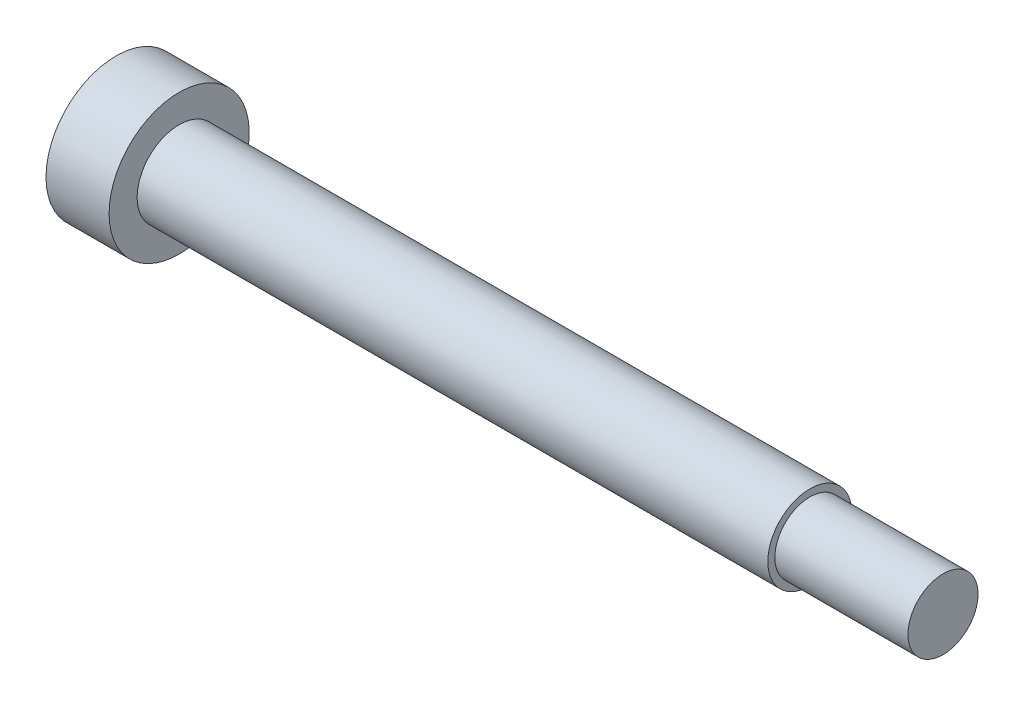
ISO-10303-21;
HEADER;
FILE_DESCRIPTION(('STEP AP214'),'2;1');
FILE_NAME('part.step','',(''),(''),'','','');
FILE_SCHEMA(('AUTOMOTIVE_DESIGN { 1 0 10303 214 1 1 1 1 }'));
ENDSEC;
DATA;
#1=APPLICATION_CONTEXT('core data for automotive mechanical design processes');
#2=APPLICATION_PROTOCOL_DEFINITION('international standard','automotive_design',2000,#1);
#3=PRODUCT_CONTEXT('',#1,'mechanical');
#4=PRODUCT('Part','Part','',(#3));
#5=PRODUCT_RELATED_PRODUCT_CATEGORY('part','',(#4));
#6=PRODUCT_DEFINITION_FORMATION('','',#4);
#7=PRODUCT_DEFINITION_CONTEXT('part definition',#1,'design');
#8=PRODUCT_DEFINITION('design','',#6,#7);
#9=PRODUCT_DEFINITION_SHAPE('','',#8);
#10=(LENGTH_UNIT() NAMED_UNIT(*) SI_UNIT(.MILLI.,.METRE.));
#11=(NAMED_UNIT(*) PLANE_ANGLE_UNIT() SI_UNIT($,.RADIAN.));
#12=(NAMED_UNIT(*) SI_UNIT($,.STERADIAN.) SOLID_ANGLE_UNIT());
#13=UNCERTAINTY_MEASURE_WITH_UNIT(LENGTH_MEASURE(1.E-05),#10,'distance_accuracy_value','');
#14=(GEOMETRIC_REPRESENTATION_CONTEXT(3) GLOBAL_UNCERTAINTY_ASSIGNED_CONTEXT((#13)) GLOBAL_UNIT_ASSIGNED_CONTEXT((#10,
#11,#12)) REPRESENTATION_CONTEXT('',''));
#15=CARTESIAN_POINT('',(0.,0.,0.));
#16=DIRECTION('',(0.,0.,1.));
#17=DIRECTION('',(1.,0.,0.));
#18=AXIS2_PLACEMENT_3D('',#15,#16,#17);
#19=CARTESIAN_POINT('',(0.,0.,0.));
#20=DIRECTION('',(1.,0.,0.));
#21=DIRECTION('',(0.,0.,-1.));
#22=AXIS2_PLACEMENT_3D('',#19,#20,#21);
#23=PLANE('',#22);
#24=DIRECTION('',(0.,0.866025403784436,-0.5));
#25=VECTOR('',#24,1.);
#26=CARTESIAN_POINT('',(0.,0.,2.));
#27=LINE('',#26,#25);
#28=CARTESIAN_POINT('',(0.,0.,2.));
#29=VERTEX_POINT('',#28);
#30=CARTESIAN_POINT('',(0.,1.73205080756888,1.));
#31=VERTEX_POINT('',#30);
#32=EDGE_CURVE('E104',#29,#31,#27,.T.);
#33=ORIENTED_EDGE('',*,*,#32,.F.);
#34=DIRECTION('',(0.,0.866025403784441,0.5));
#35=VECTOR('',#34,1.);
#36=CARTESIAN_POINT('',(0.,-1.73205080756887,1.));
#37=LINE('',#36,#35);
#38=CARTESIAN_POINT('',(0.,-1.73205080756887,1.));
#39=VERTEX_POINT('',#38);
#40=EDGE_CURVE('E30',#39,#29,#37,.T.);
#41=ORIENTED_EDGE('',*,*,#40,.F.);
#42=DIRECTION('',(0.,0.,1.));
#43=VECTOR('',#42,1.);
#44=CARTESIAN_POINT('',(0.,-1.73205080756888,-1.));
#45=LINE('',#44,#43);
#46=CARTESIAN_POINT('',(0.,-1.73205080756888,-1.));
#47=VERTEX_POINT('',#46);
#48=EDGE_CURVE('E113',#47,#39,#45,.T.);
#49=ORIENTED_EDGE('',*,*,#48,.F.);
#50=DIRECTION('',(0.,-0.866025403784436,0.5));
#51=VECTOR('',#50,1.);
#52=CARTESIAN_POINT('',(0.,0.,-2.));
#53=LINE('',#52,#51);
#54=CARTESIAN_POINT('',(0.,0.,-2.));
#55=VERTEX_POINT('',#54);
#56=EDGE_CURVE('E111',#55,#47,#53,.T.);
#57=ORIENTED_EDGE('',*,*,#56,.F.);
#58=DIRECTION('',(0.,-0.866025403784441,-0.5));
#59=VECTOR('',#58,1.);
#60=CARTESIAN_POINT('',(0.,1.73205080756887,-1.));
#61=LINE('',#60,#59);
#62=CARTESIAN_POINT('',(0.,1.73205080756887,-1.));
#63=VERTEX_POINT('',#62);
#64=EDGE_CURVE('E78',#63,#55,#61,.T.);
#65=ORIENTED_EDGE('',*,*,#64,.F.);
#66=DIRECTION('',(0.,0.,-1.));
#67=VECTOR('',#66,1.);
#68=CARTESIAN_POINT('',(0.,1.73205080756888,1.));
#69=LINE('',#68,#67);
#70=EDGE_CURVE('E107',#31,#63,#69,.T.);
#71=ORIENTED_EDGE('',*,*,#70,.F.);
#72=EDGE_LOOP('',(#33,#41,#49,#57,#65,#71));
#73=FACE_BOUND('',#72,.T.);
#74=CARTESIAN_POINT('',(0.,0.,0.));
#75=DIRECTION('',(-1.,0.,0.));
#76=DIRECTION('',(0.,0.,1.));
#77=AXIS2_PLACEMENT_3D('',#74,#75,#76);
#78=CIRCLE('',#77,5.);
#79=CARTESIAN_POINT('',(0.,0.,5.));
#80=VERTEX_POINT('',#79);
#81=EDGE_CURVE('E10',#80,#80,#78,.T.);
#82=ORIENTED_EDGE('',*,*,#81,.T.);
#83=EDGE_LOOP('',(#82));
#84=FACE_BOUND('',#83,.T.);
#85=ADVANCED_FACE('F16',(#73,#84),#23,.F.);
#86=CARTESIAN_POINT('',(0.,0.,0.));
#87=DIRECTION('',(-1.,0.,0.));
#88=DIRECTION('',(0.,0.,1.));
#89=AXIS2_PLACEMENT_3D('',#86,#87,#88);
#90=CYLINDRICAL_SURFACE('',#89,5.);
#91=ORIENTED_EDGE('',*,*,#81,.F.);
#92=EDGE_LOOP('',(#91));
#93=FACE_BOUND('',#92,.T.);
#94=CARTESIAN_POINT('',(4.5,0.,0.));
#95=DIRECTION('',(-1.,0.,0.));
#96=DIRECTION('',(0.,0.,1.));
#97=AXIS2_PLACEMENT_3D('',#94,#95,#96);
#98=CIRCLE('',#97,5.);
#99=CARTESIAN_POINT('',(4.5,0.,5.));
#100=VERTEX_POINT('',#99);
#101=EDGE_CURVE('E23',#100,#100,#98,.T.);
#102=ORIENTED_EDGE('',*,*,#101,.T.);
#103=EDGE_LOOP('',(#102));
#104=FACE_BOUND('',#103,.T.);
#105=ADVANCED_FACE('F136',(#93,#104),#90,.T.);
#106=CARTESIAN_POINT('',(4.5,5.,0.));
#107=DIRECTION('',(-1.,0.,0.));
#108=DIRECTION('',(0.,0.,1.));
#109=AXIS2_PLACEMENT_3D('',#106,#107,#108);
#110=PLANE('',#109);
#111=ORIENTED_EDGE('',*,*,#101,.F.);
#112=EDGE_LOOP('',(#111));
#113=FACE_BOUND('',#112,.T.);
#114=CARTESIAN_POINT('',(4.5,0.,0.));
#115=DIRECTION('',(-1.,0.,0.));
#116=DIRECTION('',(0.,0.,1.));
#117=AXIS2_PLACEMENT_3D('',#114,#115,#116);
#118=CIRCLE('',#117,3.);
#119=CARTESIAN_POINT('',(4.5,0.,3.));
#120=VERTEX_POINT('',#119);
#121=EDGE_CURVE('E131',#120,#120,#118,.T.);
#122=ORIENTED_EDGE('',*,*,#121,.T.);
#123=EDGE_LOOP('',(#122));
#124=FACE_BOUND('',#123,.T.);
#125=ADVANCED_FACE('F138',(#113,#124),#110,.F.);
#126=CARTESIAN_POINT('',(0.,0.,0.));
#127=DIRECTION('',(-1.,0.,0.));
#128=DIRECTION('',(0.,0.,1.));
#129=AXIS2_PLACEMENT_3D('',#126,#127,#128);
#130=CYLINDRICAL_SURFACE('',#129,3.);
#131=ORIENTED_EDGE('',*,*,#121,.F.);
#132=EDGE_LOOP('',(#131));
#133=FACE_BOUND('',#132,.T.);
#134=CARTESIAN_POINT('',(49.5,0.,0.));
#135=DIRECTION('',(-1.,0.,0.));
#136=DIRECTION('',(0.,0.,1.));
#137=AXIS2_PLACEMENT_3D('',#134,#135,#136);
#138=CIRCLE('',#137,3.);
#139=CARTESIAN_POINT('',(49.5,0.,3.));
#140=VERTEX_POINT('',#139);
#141=EDGE_CURVE('E128',#140,#140,#138,.T.);
#142=ORIENTED_EDGE('',*,*,#141,.T.);
#143=EDGE_LOOP('',(#142));
#144=FACE_BOUND('',#143,.T.);
#145=ADVANCED_FACE('F141',(#133,#144),#130,.T.);
#146=CARTESIAN_POINT('',(49.5,3.,0.));
#147=DIRECTION('',(-1.,0.,0.));
#148=DIRECTION('',(0.,0.,1.));
#149=AXIS2_PLACEMENT_3D('',#146,#147,#148);
#150=PLANE('',#149);
#151=ORIENTED_EDGE('',*,*,#141,.F.);
#152=EDGE_LOOP('',(#151));
#153=FACE_BOUND('',#152,.T.);
#154=CARTESIAN_POINT('',(49.5,0.,0.));
#155=DIRECTION('',(-1.,0.,0.));
#156=DIRECTION('',(0.,0.,1.));
#157=AXIS2_PLACEMENT_3D('',#154,#155,#156);
#158=CIRCLE('',#157,2.5);
#159=CARTESIAN_POINT('',(49.5,0.,2.5));
#160=VERTEX_POINT('',#159);
#161=EDGE_CURVE('E125',#160,#160,#158,.T.);
#162=ORIENTED_EDGE('',*,*,#161,.T.);
#163=EDGE_LOOP('',(#162));
#164=FACE_BOUND('',#163,.T.);
#165=ADVANCED_FACE('F147',(#153,#164),#150,.F.);
#166=CARTESIAN_POINT('',(0.,0.,0.));
#167=DIRECTION('',(-1.,0.,0.));
#168=DIRECTION('',(0.,0.,1.));
#169=AXIS2_PLACEMENT_3D('',#166,#167,#168);
#170=CYLINDRICAL_SURFACE('',#169,2.5);
#171=ORIENTED_EDGE('',*,*,#161,.F.);
#172=EDGE_LOOP('',(#171));
#173=FACE_BOUND('',#172,.T.);
#174=CARTESIAN_POINT('',(59.,0.,0.));
#175=DIRECTION('',(-1.,0.,0.));
#176=DIRECTION('',(0.,0.,1.));
#177=AXIS2_PLACEMENT_3D('',#174,#175,#176);
#178=CIRCLE('',#177,2.5);
#179=CARTESIAN_POINT('',(59.,0.,2.5));
#180=VERTEX_POINT('',#179);
#181=EDGE_CURVE('E117',#180,#180,#178,.T.);
#182=ORIENTED_EDGE('',*,*,#181,.T.);
#183=EDGE_LOOP('',(#182));
#184=FACE_BOUND('',#183,.T.);
#185=ADVANCED_FACE('F153',(#173,#184),#170,.T.);
#186=CARTESIAN_POINT('',(59.,2.5,0.));
#187=DIRECTION('',(-1.,0.,0.));
#188=DIRECTION('',(0.,0.,1.));
#189=AXIS2_PLACEMENT_3D('',#186,#187,#188);
#190=PLANE('',#189);
#191=ORIENTED_EDGE('',*,*,#181,.F.);
#192=EDGE_LOOP('',(#191));
#193=FACE_BOUND('',#192,.T.);
#194=ADVANCED_FACE('F159',(#193),#190,.F.);
#195=CARTESIAN_POINT('',(3.,-1.73205080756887,1.));
#196=DIRECTION('',(0.,-0.5,0.866025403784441));
#197=DIRECTION('',(0.,-0.866025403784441,-0.5));
#198=AXIS2_PLACEMENT_3D('',#195,#196,#197);
#199=PLANE('',#198);
#200=ORIENTED_EDGE('',*,*,#40,.T.);
#201=DIRECTION('',(-1.,0.,0.));
#202=VECTOR('',#201,1.);
#203=CARTESIAN_POINT('',(3.,0.,2.));
#204=LINE('',#203,#202);
#205=CARTESIAN_POINT('',(3.,0.,2.));
#206=VERTEX_POINT('',#205);
#207=EDGE_CURVE('E60',#206,#29,#204,.T.);
#208=ORIENTED_EDGE('',*,*,#207,.F.);
#209=DIRECTION('',(0.,0.866025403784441,0.5));
#210=VECTOR('',#209,1.);
#211=CARTESIAN_POINT('',(3.,-1.73205080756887,1.));
#212=LINE('',#211,#210);
#213=CARTESIAN_POINT('',(3.,-1.73205080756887,1.));
#214=VERTEX_POINT('',#213);
#215=EDGE_CURVE('E115',#214,#206,#212,.T.);
#216=ORIENTED_EDGE('',*,*,#215,.F.);
#217=DIRECTION('',(-1.,0.,0.));
#218=VECTOR('',#217,1.);
#219=CARTESIAN_POINT('',(3.,-1.73205080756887,1.));
#220=LINE('',#219,#218);
#221=EDGE_CURVE('E38',#214,#39,#220,.T.);
#222=ORIENTED_EDGE('',*,*,#221,.T.);
#223=EDGE_LOOP('',(#200,#208,#216,#222));
#224=FACE_BOUND('',#223,.T.);
#225=ADVANCED_FACE('F164',(#224),#199,.F.);
#226=CARTESIAN_POINT('',(3.,-1.73205080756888,-1.));
#227=DIRECTION('',(0.,-1.,0.));
#228=DIRECTION('',(0.,0.,-1.));
#229=AXIS2_PLACEMENT_3D('',#226,#227,#228);
#230=PLANE('',#229);
#231=ORIENTED_EDGE('',*,*,#48,.T.);
#232=ORIENTED_EDGE('',*,*,#221,.F.);
#233=DIRECTION('',(0.,0.,1.));
#234=VECTOR('',#233,1.);
#235=CARTESIAN_POINT('',(3.,-1.73205080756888,-1.));
#236=LINE('',#235,#234);
#237=CARTESIAN_POINT('',(3.,-1.73205080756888,-1.));
#238=VERTEX_POINT('',#237);
#239=EDGE_CURVE('E90',#238,#214,#236,.T.);
#240=ORIENTED_EDGE('',*,*,#239,.F.);
#241=DIRECTION('',(-1.,0.,0.));
#242=VECTOR('',#241,1.);
#243=CARTESIAN_POINT('',(3.,-1.73205080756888,-1.));
#244=LINE('',#243,#242);
#245=EDGE_CURVE('E82',#238,#47,#244,.T.);
#246=ORIENTED_EDGE('',*,*,#245,.T.);
#247=EDGE_LOOP('',(#231,#232,#240,#246));
#248=FACE_BOUND('',#247,.T.);
#249=ADVANCED_FACE('F171',(#248),#230,.F.);
#250=CARTESIAN_POINT('',(3.,0.,-2.));
#251=DIRECTION('',(0.,-0.5,-0.866025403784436));
#252=DIRECTION('',(0.,0.866025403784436,-0.5));
#253=AXIS2_PLACEMENT_3D('',#250,#251,#252);
#254=PLANE('',#253);
#255=ORIENTED_EDGE('',*,*,#56,.T.);
#256=ORIENTED_EDGE('',*,*,#245,.F.);
#257=DIRECTION('',(0.,-0.866025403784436,0.5));
#258=VECTOR('',#257,1.);
#259=CARTESIAN_POINT('',(3.,0.,-2.));
#260=LINE('',#259,#258);
#261=CARTESIAN_POINT('',(3.,0.,-2.));
#262=VERTEX_POINT('',#261);
#263=EDGE_CURVE('E86',#262,#238,#260,.T.);
#264=ORIENTED_EDGE('',*,*,#263,.F.);
#265=DIRECTION('',(-1.,0.,0.));
#266=VECTOR('',#265,1.);
#267=CARTESIAN_POINT('',(3.,0.,-2.));
#268=LINE('',#267,#266);
#269=EDGE_CURVE('E71',#262,#55,#268,.T.);
#270=ORIENTED_EDGE('',*,*,#269,.T.);
#271=EDGE_LOOP('',(#255,#256,#264,#270));
#272=FACE_BOUND('',#271,.T.);
#273=ADVANCED_FACE('F87',(#272),#254,.F.);
#274=CARTESIAN_POINT('',(3.,1.73205080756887,-1.));
#275=DIRECTION('',(0.,0.5,-0.866025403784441));
#276=DIRECTION('',(0.,0.866025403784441,0.5));
#277=AXIS2_PLACEMENT_3D('',#274,#275,#276);
#278=PLANE('',#277);
#279=ORIENTED_EDGE('',*,*,#64,.T.);
#280=ORIENTED_EDGE('',*,*,#269,.F.);
#281=DIRECTION('',(0.,-0.866025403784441,-0.5));
#282=VECTOR('',#281,1.);
#283=CARTESIAN_POINT('',(3.,1.73205080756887,-1.));
#284=LINE('',#283,#282);
#285=CARTESIAN_POINT('',(3.,1.73205080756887,-1.));
#286=VERTEX_POINT('',#285);
#287=EDGE_CURVE('E75',#286,#262,#284,.T.);
#288=ORIENTED_EDGE('',*,*,#287,.F.);
#289=DIRECTION('',(-1.,0.,0.));
#290=VECTOR('',#289,1.);
#291=CARTESIAN_POINT('',(3.,1.73205080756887,-1.));
#292=LINE('',#291,#290);
#293=EDGE_CURVE('E83',#286,#63,#292,.T.);
#294=ORIENTED_EDGE('',*,*,#293,.T.);
#295=EDGE_LOOP('',(#279,#280,#288,#294));
#296=FACE_BOUND('',#295,.T.);
#297=ADVANCED_FACE('F73',(#296),#278,.F.);
#298=CARTESIAN_POINT('',(3.,1.73205080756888,1.));
#299=DIRECTION('',(0.,1.,0.));
#300=DIRECTION('',(0.,0.,1.));
#301=AXIS2_PLACEMENT_3D('',#298,#299,#300);
#302=PLANE('',#301);
#303=ORIENTED_EDGE('',*,*,#70,.T.);
#304=ORIENTED_EDGE('',*,*,#293,.F.);
#305=DIRECTION('',(0.,0.,-1.));
#306=VECTOR('',#305,1.);
#307=CARTESIAN_POINT('',(3.,1.73205080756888,1.));
#308=LINE('',#307,#306);
#309=CARTESIAN_POINT('',(3.,1.73205080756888,1.));
#310=VERTEX_POINT('',#309);
#311=EDGE_CURVE('E96',#310,#286,#308,.T.);
#312=ORIENTED_EDGE('',*,*,#311,.F.);
#313=DIRECTION('',(-1.,0.,0.));
#314=VECTOR('',#313,1.);
#315=CARTESIAN_POINT('',(3.,1.73205080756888,1.));
#316=LINE('',#315,#314);
#317=EDGE_CURVE('E120',#310,#31,#316,.T.);
#318=ORIENTED_EDGE('',*,*,#317,.T.);
#319=EDGE_LOOP('',(#303,#304,#312,#318));
#320=FACE_BOUND('',#319,.T.);
#321=ADVANCED_FACE('F199',(#320),#302,.F.);
#322=CARTESIAN_POINT('',(3.,0.,2.));
#323=DIRECTION('',(0.,0.5,0.866025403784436));
#324=DIRECTION('',(0.,-0.866025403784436,0.5));
#325=AXIS2_PLACEMENT_3D('',#322,#323,#324);
#326=PLANE('',#325);
#327=ORIENTED_EDGE('',*,*,#32,.T.);
#328=ORIENTED_EDGE('',*,*,#317,.F.);
#329=DIRECTION('',(0.,0.866025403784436,-0.5));
#330=VECTOR('',#329,1.);
#331=CARTESIAN_POINT('',(3.,0.,2.));
#332=LINE('',#331,#330);
#333=EDGE_CURVE('E98',#206,#310,#332,.T.);
#334=ORIENTED_EDGE('',*,*,#333,.F.);
#335=ORIENTED_EDGE('',*,*,#207,.T.);
#336=EDGE_LOOP('',(#327,#328,#334,#335));
#337=FACE_BOUND('',#336,.T.);
#338=ADVANCED_FACE('F186',(#337),#326,.F.);
#339=CARTESIAN_POINT('',(3.,0.,0.));
#340=DIRECTION('',(-1.,0.,0.));
#341=DIRECTION('',(0.,0.,1.));
#342=AXIS2_PLACEMENT_3D('',#339,#340,#341);
#343=PLANE('',#342);
#344=ORIENTED_EDGE('',*,*,#215,.T.);
#345=ORIENTED_EDGE('',*,*,#333,.T.);
#346=ORIENTED_EDGE('',*,*,#311,.T.);
#347=ORIENTED_EDGE('',*,*,#287,.T.);
#348=ORIENTED_EDGE('',*,*,#263,.T.);
#349=ORIENTED_EDGE('',*,*,#239,.T.);
#350=EDGE_LOOP('',(#344,#345,#346,#347,#348,#349));
#351=FACE_BOUND('',#350,.T.);
#352=ADVANCED_FACE('F93',(#351),#343,.T.);
#353=CLOSED_SHELL('',(#85,#105,#125,#145,#165,#185,#194,#225,#249,#273,#297,#321,#338,#352));
#354=MANIFOLD_SOLID_BREP('B1',#353);
#355=ADVANCED_BREP_SHAPE_REPRESENTATION('',(#18,#354),#14);
#356=SHAPE_DEFINITION_REPRESENTATION(#9,#355);
ENDSEC;
END-ISO-10303-21;
